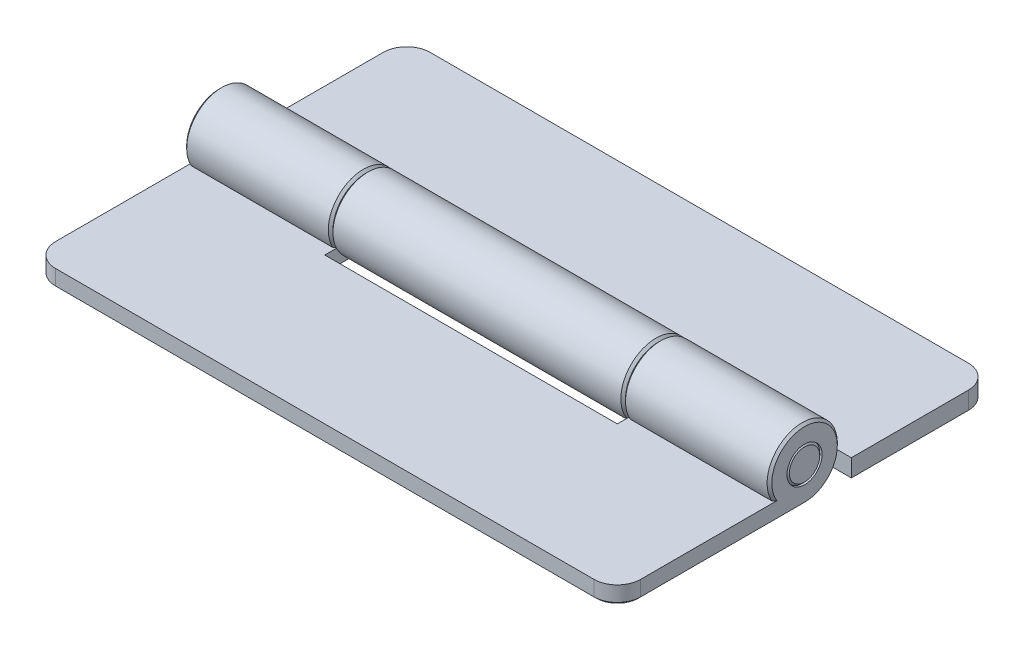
ISO-10303-21;
HEADER;
FILE_DESCRIPTION(('STEP AP214'),'2;1');
FILE_NAME('part.step','',(''),(''),'','','');
FILE_SCHEMA(('AUTOMOTIVE_DESIGN { 1 0 10303 214 1 1 1 1 }'));
ENDSEC;
DATA;
#1=APPLICATION_CONTEXT('core data for automotive mechanical design processes');
#2=APPLICATION_PROTOCOL_DEFINITION('international standard','automotive_design',2000,#1);
#3=PRODUCT_CONTEXT('',#1,'mechanical');
#4=PRODUCT('Part','Part','',(#3));
#5=PRODUCT_RELATED_PRODUCT_CATEGORY('part','',(#4));
#6=PRODUCT_DEFINITION_FORMATION('','',#4);
#7=PRODUCT_DEFINITION_CONTEXT('part definition',#1,'design');
#8=PRODUCT_DEFINITION('design','',#6,#7);
#9=PRODUCT_DEFINITION_SHAPE('','',#8);
#10=(LENGTH_UNIT() NAMED_UNIT(*) SI_UNIT(.MILLI.,.METRE.));
#11=(NAMED_UNIT(*) PLANE_ANGLE_UNIT() SI_UNIT($,.RADIAN.));
#12=(NAMED_UNIT(*) SI_UNIT($,.STERADIAN.) SOLID_ANGLE_UNIT());
#13=UNCERTAINTY_MEASURE_WITH_UNIT(LENGTH_MEASURE(1.E-05),#10,'distance_accuracy_value','');
#14=(GEOMETRIC_REPRESENTATION_CONTEXT(3) GLOBAL_UNCERTAINTY_ASSIGNED_CONTEXT((#13)) GLOBAL_UNIT_ASSIGNED_CONTEXT((#10,
#11,#12)) REPRESENTATION_CONTEXT('',''));
#15=CARTESIAN_POINT('',(0.,0.,0.));
#16=DIRECTION('',(0.,0.,1.));
#17=DIRECTION('',(1.,0.,0.));
#18=AXIS2_PLACEMENT_3D('',#15,#16,#17);
#19=CARTESIAN_POINT('',(25.,0.,0.));
#20=DIRECTION('',(-1.,0.,0.));
#21=DIRECTION('',(0.,0.,1.));
#22=AXIS2_PLACEMENT_3D('',#19,#20,#21);
#23=CYLINDRICAL_SURFACE('',#22,3.);
#24=DIRECTION('',(-1.,0.,0.));
#25=VECTOR('',#24,1.);
#26=CARTESIAN_POINT('',(25.,-1.5,2.59807621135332));
#27=LINE('',#26,#25);
#28=CARTESIAN_POINT('',(24.8,-1.5,2.59807621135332));
#29=VERTEX_POINT('',#28);
#30=CARTESIAN_POINT('',(12.7,-1.5,2.59807621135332));
#31=VERTEX_POINT('',#30);
#32=EDGE_CURVE('P0_E190',#29,#31,#27,.T.);
#33=ORIENTED_EDGE('',*,*,#32,.F.);
#34=CARTESIAN_POINT('',(24.8,0.,0.));
#35=DIRECTION('',(1.,0.,0.));
#36=DIRECTION('',(0.,0.,-1.));
#37=AXIS2_PLACEMENT_3D('',#34,#35,#36);
#38=CIRCLE('',#37,3.);
#39=CARTESIAN_POINT('',(24.8,-3.,0.));
#40=VERTEX_POINT('',#39);
#41=EDGE_CURVE('P0_E206',#29,#40,#38,.F.);
#42=ORIENTED_EDGE('',*,*,#41,.T.);
#43=DIRECTION('',(-1.,0.,0.));
#44=VECTOR('',#43,1.);
#45=CARTESIAN_POINT('',(25.,-3.,0.));
#46=LINE('',#45,#44);
#47=CARTESIAN_POINT('',(12.7,-3.,0.));
#48=VERTEX_POINT('',#47);
#49=EDGE_CURVE('P0_E140',#40,#48,#46,.T.);
#50=ORIENTED_EDGE('',*,*,#49,.T.);
#51=CARTESIAN_POINT('',(12.7,0.,0.));
#52=DIRECTION('',(1.,0.,0.));
#53=DIRECTION('',(0.,0.,-1.));
#54=AXIS2_PLACEMENT_3D('',#51,#52,#53);
#55=CIRCLE('',#54,3.);
#56=EDGE_CURVE('P0_E204',#48,#31,#55,.T.);
#57=ORIENTED_EDGE('',*,*,#56,.T.);
#58=EDGE_LOOP('',(#33,#42,#50,#57));
#59=FACE_BOUND('',#58,.T.);
#60=ADVANCED_FACE('P0_F15',(#59),#23,.T.);
#61=CARTESIAN_POINT('',(25.,0.,0.));
#62=DIRECTION('',(1.,0.,0.));
#63=DIRECTION('',(0.,0.,-1.));
#64=AXIS2_PLACEMENT_3D('',#61,#62,#63);
#65=PLANE('',#64);
#66=CARTESIAN_POINT('',(25.,0.,0.));
#67=DIRECTION('',(1.,0.,0.));
#68=DIRECTION('',(0.,0.,-1.));
#69=AXIS2_PLACEMENT_3D('',#66,#67,#68);
#70=CIRCLE('',#69,2.8);
#71=CARTESIAN_POINT('',(25.,-2.8,0.));
#72=VERTEX_POINT('',#71);
#73=CARTESIAN_POINT('',(25.,-1.5,2.36431808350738));
#74=VERTEX_POINT('',#73);
#75=EDGE_CURVE('P0_E201',#72,#74,#70,.T.);
#76=ORIENTED_EDGE('',*,*,#75,.T.);
#77=DIRECTION('',(0.,0.,-1.));
#78=VECTOR('',#77,1.);
#79=CARTESIAN_POINT('',(25.,-1.5,0.));
#80=LINE('',#79,#78);
#81=CARTESIAN_POINT('',(25.,-1.5,14.));
#82=VERTEX_POINT('',#81);
#83=EDGE_CURVE('P0_E166',#82,#74,#80,.T.);
#84=ORIENTED_EDGE('',*,*,#83,.F.);
#85=DIRECTION('',(0.,-1.,0.));
#86=VECTOR('',#85,1.);
#87=CARTESIAN_POINT('',(25.,-1.5,14.));
#88=LINE('',#87,#86);
#89=CARTESIAN_POINT('',(25.,-2.8,14.));
#90=VERTEX_POINT('',#89);
#91=EDGE_CURVE('P0_E178',#82,#90,#88,.T.);
#92=ORIENTED_EDGE('',*,*,#91,.T.);
#93=DIRECTION('',(0.,0.,-1.));
#94=VECTOR('',#93,1.);
#95=CARTESIAN_POINT('',(25.,-2.8,0.));
#96=LINE('',#95,#94);
#97=EDGE_CURVE('P0_E197',#90,#72,#96,.T.);
#98=ORIENTED_EDGE('',*,*,#97,.T.);
#99=EDGE_LOOP('',(#76,#84,#92,#98));
#100=FACE_BOUND('',#99,.T.);
#101=CARTESIAN_POINT('',(25.,0.,0.));
#102=DIRECTION('',(1.,0.,0.));
#103=DIRECTION('',(0.,0.,-1.));
#104=AXIS2_PLACEMENT_3D('',#101,#102,#103);
#105=CIRCLE('',#104,1.5);
#106=CARTESIAN_POINT('',(25.,0.,-1.5));
#107=VERTEX_POINT('',#106);
#108=EDGE_CURVE('P0_E194',#107,#107,#105,.T.);
#109=ORIENTED_EDGE('',*,*,#108,.F.);
#110=EDGE_LOOP('',(#109));
#111=FACE_BOUND('',#110,.T.);
#112=ADVANCED_FACE('P0_F360',(#100,#111),#65,.T.);
#113=CARTESIAN_POINT('',(12.5,0.,0.));
#114=DIRECTION('',(1.,0.,0.));
#115=DIRECTION('',(0.,0.,-1.));
#116=AXIS2_PLACEMENT_3D('',#113,#114,#115);
#117=PLANE('',#116);
#118=CARTESIAN_POINT('',(12.5,0.,0.));
#119=DIRECTION('',(1.,0.,0.));
#120=DIRECTION('',(0.,0.,-1.));
#121=AXIS2_PLACEMENT_3D('',#118,#119,#120);
#122=CIRCLE('',#121,2.8);
#123=CARTESIAN_POINT('',(12.5,-1.5,2.36431808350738));
#124=VERTEX_POINT('',#123);
#125=CARTESIAN_POINT('',(12.5,-2.8,0.));
#126=VERTEX_POINT('',#125);
#127=EDGE_CURVE('P0_E208',#124,#126,#122,.F.);
#128=ORIENTED_EDGE('',*,*,#127,.T.);
#129=DIRECTION('',(0.,0.,1.));
#130=VECTOR('',#129,1.);
#131=CARTESIAN_POINT('',(12.5,-2.8,3.5));
#132=LINE('',#131,#130);
#133=CARTESIAN_POINT('',(12.5,-2.8,3.5));
#134=VERTEX_POINT('',#133);
#135=EDGE_CURVE('P0_E210',#126,#134,#132,.T.);
#136=ORIENTED_EDGE('',*,*,#135,.T.);
#137=DIRECTION('',(0.,-1.,0.));
#138=VECTOR('',#137,1.);
#139=CARTESIAN_POINT('',(12.5,-1.5,3.5));
#140=LINE('',#139,#138);
#141=CARTESIAN_POINT('',(12.5,-1.5,3.5));
#142=VERTEX_POINT('',#141);
#143=EDGE_CURVE('P0_E187',#142,#134,#140,.T.);
#144=ORIENTED_EDGE('',*,*,#143,.F.);
#145=DIRECTION('',(0.,0.,1.));
#146=VECTOR('',#145,1.);
#147=CARTESIAN_POINT('',(12.5,-1.5,0.));
#148=LINE('',#147,#146);
#149=EDGE_CURVE('P0_E168',#124,#142,#148,.T.);
#150=ORIENTED_EDGE('',*,*,#149,.F.);
#151=EDGE_LOOP('',(#128,#136,#144,#150));
#152=FACE_BOUND('',#151,.T.);
#153=CARTESIAN_POINT('',(12.5,0.,0.));
#154=DIRECTION('',(1.,0.,0.));
#155=DIRECTION('',(0.,0.,-1.));
#156=AXIS2_PLACEMENT_3D('',#153,#154,#155);
#157=CIRCLE('',#156,1.5);
#158=CARTESIAN_POINT('',(12.5,0.,-1.5));
#159=VERTEX_POINT('',#158);
#160=EDGE_CURVE('P0_E193',#159,#159,#157,.T.);
#161=ORIENTED_EDGE('',*,*,#160,.T.);
#162=EDGE_LOOP('',(#161));
#163=FACE_BOUND('',#162,.T.);
#164=ADVANCED_FACE('P0_F365',(#152,#163),#117,.F.);
#165=CARTESIAN_POINT('',(25.,0.,0.));
#166=DIRECTION('',(-1.,0.,0.));
#167=DIRECTION('',(0.,0.,1.));
#168=AXIS2_PLACEMENT_3D('',#165,#166,#167);
#169=CYLINDRICAL_SURFACE('',#168,1.5);
#170=ORIENTED_EDGE('',*,*,#160,.F.);
#171=EDGE_LOOP('',(#170));
#172=FACE_BOUND('',#171,.T.);
#173=ORIENTED_EDGE('',*,*,#108,.T.);
#174=EDGE_LOOP('',(#173));
#175=FACE_BOUND('',#174,.T.);
#176=ADVANCED_FACE('P0_F561',(#172,#175),#169,.F.);
#177=CARTESIAN_POINT('',(23.,-1.5,14.));
#178=DIRECTION('',(0.,-1.,0.));
#179=DIRECTION('',(0.,0.,-1.));
#180=AXIS2_PLACEMENT_3D('',#177,#178,#179);
#181=PLANE('',#180);
#182=DIRECTION('',(0.,0.,1.));
#183=VECTOR('',#182,1.);
#184=CARTESIAN_POINT('',(-12.5,-1.5,0.));
#185=LINE('',#184,#183);
#186=CARTESIAN_POINT('',(-12.5,-1.5,2.36431808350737));
#187=VERTEX_POINT('',#186);
#188=CARTESIAN_POINT('',(-12.5,-1.5,3.5));
#189=VERTEX_POINT('',#188);
#190=EDGE_CURVE('P0_E154',#187,#189,#185,.T.);
#191=ORIENTED_EDGE('',*,*,#190,.F.);
#192=CARTESIAN_POINT('',(-12.5,-1.5,2.36431808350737));
#193=CARTESIAN_POINT('',(-12.5330904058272,-1.5,2.4034856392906));
#194=CARTESIAN_POINT('',(-12.566302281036,-1.5,2.44254926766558));
#195=CARTESIAN_POINT('',(-12.6329689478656,-1.5,2.52046864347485));
#196=CARTESIAN_POINT('',(-12.6664237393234,-1.5,2.55932439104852));
#197=CARTESIAN_POINT('',(-12.7,-1.5,2.59807621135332));
#198=B_SPLINE_CURVE_WITH_KNOTS('',3,(#192,#193,#194,#195,#196,#197),.UNSPECIFIED.,.F.,.F.,(4,2,
4),(0.,0.153821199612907,0.307642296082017),.UNSPECIFIED.);
#199=CARTESIAN_POINT('',(-12.7,-1.5,2.59807621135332));
#200=VERTEX_POINT('',#199);
#201=EDGE_CURVE('P0_E25',#187,#200,#198,.T.);
#202=ORIENTED_EDGE('',*,*,#201,.T.);
#203=DIRECTION('',(1.,0.,0.));
#204=VECTOR('',#203,1.);
#205=CARTESIAN_POINT('',(-25.,-1.5,2.59807621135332));
#206=LINE('',#205,#204);
#207=CARTESIAN_POINT('',(-24.8,-1.5,2.59807621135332));
#208=VERTEX_POINT('',#207);
#209=EDGE_CURVE('P0_E162',#200,#208,#206,.F.);
#210=ORIENTED_EDGE('',*,*,#209,.T.);
#211=CARTESIAN_POINT('',(-24.8,-1.5,2.59807621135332));
#212=CARTESIAN_POINT('',(-24.8335762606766,-1.5,2.55932439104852));
#213=CARTESIAN_POINT('',(-24.8670310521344,-1.5,2.52046864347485));
#214=CARTESIAN_POINT('',(-24.933697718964,-1.5,2.44254926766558));
#215=CARTESIAN_POINT('',(-24.9669095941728,-1.5,2.4034856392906));
#216=CARTESIAN_POINT('',(-25.,-1.5,2.36431808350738));
#217=B_SPLINE_CURVE_WITH_KNOTS('',3,(#211,#212,#213,#214,#215,#216),.UNSPECIFIED.,.F.,.F.,(4,2,
4),(0.,0.153821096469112,0.307642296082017),.UNSPECIFIED.);
#218=CARTESIAN_POINT('',(-25.,-1.5,2.36431808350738));
#219=VERTEX_POINT('',#218);
#220=EDGE_CURVE('P0_E10',#208,#219,#217,.T.);
#221=ORIENTED_EDGE('',*,*,#220,.T.);
#222=DIRECTION('',(0.,0.,-1.));
#223=VECTOR('',#222,1.);
#224=CARTESIAN_POINT('',(-25.,-1.5,0.));
#225=LINE('',#224,#223);
#226=CARTESIAN_POINT('',(-25.,-1.5,14.));
#227=VERTEX_POINT('',#226);
#228=EDGE_CURVE('P0_E38',#227,#219,#225,.T.);
#229=ORIENTED_EDGE('',*,*,#228,.F.);
#230=CARTESIAN_POINT('',(-23.,-1.5,14.));
#231=DIRECTION('',(0.,-1.,0.));
#232=DIRECTION('',(0.,0.,-1.));
#233=AXIS2_PLACEMENT_3D('',#230,#231,#232);
#234=CIRCLE('',#233,2.);
#235=CARTESIAN_POINT('',(-23.,-1.5,16.));
#236=VERTEX_POINT('',#235);
#237=EDGE_CURVE('P0_E146',#236,#227,#234,.T.);
#238=ORIENTED_EDGE('',*,*,#237,.F.);
#239=DIRECTION('',(1.,0.,0.));
#240=VECTOR('',#239,1.);
#241=CARTESIAN_POINT('',(23.,-1.5,16.));
#242=LINE('',#241,#240);
#243=CARTESIAN_POINT('',(23.,-1.5,16.));
#244=VERTEX_POINT('',#243);
#245=EDGE_CURVE('P0_E174',#236,#244,#242,.T.);
#246=ORIENTED_EDGE('',*,*,#245,.T.);
#247=CARTESIAN_POINT('',(23.,-1.5,14.));
#248=DIRECTION('',(0.,1.,0.));
#249=DIRECTION('',(0.,0.,-1.));
#250=AXIS2_PLACEMENT_3D('',#247,#248,#249);
#251=CIRCLE('',#250,2.);
#252=EDGE_CURVE('P0_E176',#244,#82,#251,.T.);
#253=ORIENTED_EDGE('',*,*,#252,.T.);
#254=ORIENTED_EDGE('',*,*,#83,.T.);
#255=CARTESIAN_POINT('',(25.,-1.5,2.36431808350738));
#256=CARTESIAN_POINT('',(24.9669095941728,-1.5,2.40348563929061));
#257=CARTESIAN_POINT('',(24.933697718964,-1.5,2.44254926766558));
#258=CARTESIAN_POINT('',(24.8670310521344,-1.5,2.52046864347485));
#259=CARTESIAN_POINT('',(24.8335762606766,-1.5,2.55932439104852));
#260=CARTESIAN_POINT('',(24.8,-1.5,2.59807621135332));
#261=B_SPLINE_CURVE_WITH_KNOTS('',3,(#255,#256,#257,#258,#259,#260),.UNSPECIFIED.,.F.,.F.,(4,2,
4),(0.,0.153821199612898,0.307642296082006),.UNSPECIFIED.);
#262=EDGE_CURVE('P0_E245',#74,#29,#261,.T.);
#263=ORIENTED_EDGE('',*,*,#262,.T.);
#264=ORIENTED_EDGE('',*,*,#32,.T.);
#265=CARTESIAN_POINT('',(12.7,-1.5,2.59807621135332));
#266=CARTESIAN_POINT('',(12.6664237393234,-1.5,2.55932439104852));
#267=CARTESIAN_POINT('',(12.6329689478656,-1.5,2.52046864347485));
#268=CARTESIAN_POINT('',(12.566302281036,-1.5,2.44254926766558));
#269=CARTESIAN_POINT('',(12.5330904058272,-1.5,2.40348563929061));
#270=CARTESIAN_POINT('',(12.5,-1.5,2.36431808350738));
#271=B_SPLINE_CURVE_WITH_KNOTS('',3,(#265,#266,#267,#268,#269,#270),.UNSPECIFIED.,.F.,.F.,(4,2,
4),(0.,0.15382109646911,0.307642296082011),.UNSPECIFIED.);
#272=EDGE_CURVE('P0_E346',#31,#124,#271,.T.);
#273=ORIENTED_EDGE('',*,*,#272,.T.);
#274=ORIENTED_EDGE('',*,*,#149,.T.);
#275=DIRECTION('',(-1.,0.,0.));
#276=VECTOR('',#275,1.);
#277=CARTESIAN_POINT('',(12.5,-1.5,3.5));
#278=LINE('',#277,#276);
#279=EDGE_CURVE('P0_E171',#142,#189,#278,.T.);
#280=ORIENTED_EDGE('',*,*,#279,.T.);
#281=EDGE_LOOP('',(#191,#202,#210,#221,#229,#238,#246,#253,#254,#263,#264,#273,#274,#280));
#282=FACE_BOUND('',#281,.T.);
#283=ADVANCED_FACE('P0_F145',(#282),#181,.F.);
#284=CARTESIAN_POINT('',(12.5,-1.5,3.5));
#285=DIRECTION('',(0.,0.,1.));
#286=DIRECTION('',(1.,0.,0.));
#287=AXIS2_PLACEMENT_3D('',#284,#285,#286);
#288=PLANE('',#287);
#289=DIRECTION('',(-1.,0.,0.));
#290=VECTOR('',#289,1.);
#291=CARTESIAN_POINT('',(12.5,-3.,3.5));
#292=LINE('',#291,#290);
#293=CARTESIAN_POINT('',(12.7,-3.,3.5));
#294=VERTEX_POINT('',#293);
#295=CARTESIAN_POINT('',(-12.7,-3.,3.50000000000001));
#296=VERTEX_POINT('',#295);
#297=EDGE_CURVE('P0_E169',#294,#296,#292,.T.);
#298=ORIENTED_EDGE('',*,*,#297,.T.);
#299=DIRECTION('',(-0.707106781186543,-0.707106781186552,0.));
#300=VECTOR('',#299,1.);
#301=CARTESIAN_POINT('',(0.649999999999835,10.35,3.5));
#302=LINE('',#301,#300);
#303=CARTESIAN_POINT('',(-12.5,-2.8,3.5));
#304=VERTEX_POINT('',#303);
#305=EDGE_CURVE('P0_E344',#296,#304,#302,.F.);
#306=ORIENTED_EDGE('',*,*,#305,.T.);
#307=DIRECTION('',(0.,-1.,0.));
#308=VECTOR('',#307,1.);
#309=CARTESIAN_POINT('',(-12.5,-1.5,3.5));
#310=LINE('',#309,#308);
#311=EDGE_CURVE('P0_E156',#189,#304,#310,.T.);
#312=ORIENTED_EDGE('',*,*,#311,.F.);
#313=ORIENTED_EDGE('',*,*,#279,.F.);
#314=ORIENTED_EDGE('',*,*,#143,.T.);
#315=DIRECTION('',(0.707106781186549,-0.707106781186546,0.));
#316=VECTOR('',#315,1.);
#317=CARTESIAN_POINT('',(11.85,-2.15,3.5));
#318=LINE('',#317,#316);
#319=EDGE_CURVE('P0_E252',#134,#294,#318,.T.);
#320=ORIENTED_EDGE('',*,*,#319,.T.);
#321=EDGE_LOOP('',(#298,#306,#312,#313,#314,#320));
#322=FACE_BOUND('',#321,.T.);
#323=ADVANCED_FACE('P0_F343',(#322),#288,.F.);
#324=CARTESIAN_POINT('',(23.,-1.5,16.));
#325=DIRECTION('',(0.,0.,-1.));
#326=DIRECTION('',(-1.,0.,0.));
#327=AXIS2_PLACEMENT_3D('',#324,#325,#326);
#328=PLANE('',#327);
#329=DIRECTION('',(0.,-1.,0.));
#330=VECTOR('',#329,1.);
#331=CARTESIAN_POINT('',(-23.,-1.5,16.));
#332=LINE('',#331,#330);
#333=CARTESIAN_POINT('',(-23.,-2.8,16.));
#334=VERTEX_POINT('',#333);
#335=EDGE_CURVE('P0_E141',#236,#334,#332,.T.);
#336=ORIENTED_EDGE('',*,*,#335,.T.);
#337=DIRECTION('',(1.,0.,0.));
#338=VECTOR('',#337,1.);
#339=CARTESIAN_POINT('',(23.,-2.8,16.));
#340=LINE('',#339,#338);
#341=CARTESIAN_POINT('',(23.,-2.8,16.));
#342=VERTEX_POINT('',#341);
#343=EDGE_CURVE('P0_E239',#334,#342,#340,.T.);
#344=ORIENTED_EDGE('',*,*,#343,.T.);
#345=DIRECTION('',(0.,-1.,0.));
#346=VECTOR('',#345,1.);
#347=CARTESIAN_POINT('',(23.,-1.5,16.));
#348=LINE('',#347,#346);
#349=EDGE_CURVE('P0_E184',#244,#342,#348,.T.);
#350=ORIENTED_EDGE('',*,*,#349,.F.);
#351=ORIENTED_EDGE('',*,*,#245,.F.);
#352=EDGE_LOOP('',(#336,#344,#350,#351));
#353=FACE_BOUND('',#352,.T.);
#354=ADVANCED_FACE('P0_F537',(#353),#328,.F.);
#355=CARTESIAN_POINT('',(23.,-1.5,14.));
#356=DIRECTION('',(0.,-1.,0.));
#357=DIRECTION('',(0.,0.,-1.));
#358=AXIS2_PLACEMENT_3D('',#355,#356,#357);
#359=CYLINDRICAL_SURFACE('',#358,2.);
#360=ORIENTED_EDGE('',*,*,#349,.T.);
#361=CARTESIAN_POINT('',(23.,-2.8,14.));
#362=DIRECTION('',(0.,-1.,0.));
#363=DIRECTION('',(0.,0.,-1.));
#364=AXIS2_PLACEMENT_3D('',#361,#362,#363);
#365=CIRCLE('',#364,2.);
#366=EDGE_CURVE('P0_E237',#342,#90,#365,.F.);
#367=ORIENTED_EDGE('',*,*,#366,.T.);
#368=ORIENTED_EDGE('',*,*,#91,.F.);
#369=ORIENTED_EDGE('',*,*,#252,.F.);
#370=EDGE_LOOP('',(#360,#367,#368,#369));
#371=FACE_BOUND('',#370,.T.);
#372=ADVANCED_FACE('P0_F416',(#371),#359,.T.);
#373=CARTESIAN_POINT('',(23.,-3.,14.));
#374=DIRECTION('',(0.,-1.,0.));
#375=DIRECTION('',(0.,0.,-1.));
#376=AXIS2_PLACEMENT_3D('',#373,#374,#375);
#377=PLANE('',#376);
#378=ORIENTED_EDGE('',*,*,#297,.F.);
#379=DIRECTION('',(0.,0.,-1.));
#380=VECTOR('',#379,1.);
#381=CARTESIAN_POINT('',(12.7,-3.,0.));
#382=LINE('',#381,#380);
#383=EDGE_CURVE('P0_E226',#294,#48,#382,.T.);
#384=ORIENTED_EDGE('',*,*,#383,.T.);
#385=ORIENTED_EDGE('',*,*,#49,.F.);
#386=DIRECTION('',(0.,0.,1.));
#387=VECTOR('',#386,1.);
#388=CARTESIAN_POINT('',(24.8,-3.,14.));
#389=LINE('',#388,#387);
#390=CARTESIAN_POINT('',(24.8,-3.,14.));
#391=VERTEX_POINT('',#390);
#392=EDGE_CURVE('P0_E221',#40,#391,#389,.T.);
#393=ORIENTED_EDGE('',*,*,#392,.T.);
#394=CARTESIAN_POINT('',(23.,-3.,14.));
#395=DIRECTION('',(0.,-1.,0.));
#396=DIRECTION('',(0.,0.,-1.));
#397=AXIS2_PLACEMENT_3D('',#394,#395,#396);
#398=CIRCLE('',#397,1.8);
#399=CARTESIAN_POINT('',(23.,-3.,15.8));
#400=VERTEX_POINT('',#399);
#401=EDGE_CURVE('P0_E219',#391,#400,#398,.T.);
#402=ORIENTED_EDGE('',*,*,#401,.T.);
#403=DIRECTION('',(-1.,0.,0.));
#404=VECTOR('',#403,1.);
#405=CARTESIAN_POINT('',(-23.,-3.,15.8));
#406=LINE('',#405,#404);
#407=CARTESIAN_POINT('',(-23.,-3.,15.8));
#408=VERTEX_POINT('',#407);
#409=EDGE_CURVE('P0_E217',#400,#408,#406,.T.);
#410=ORIENTED_EDGE('',*,*,#409,.T.);
#411=CARTESIAN_POINT('',(-23.,-3.,14.));
#412=DIRECTION('',(0.,-1.,0.));
#413=DIRECTION('',(0.,0.,-1.));
#414=AXIS2_PLACEMENT_3D('',#411,#412,#413);
#415=CIRCLE('',#414,1.79999999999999);
#416=CARTESIAN_POINT('',(-24.8,-3.,14.));
#417=VERTEX_POINT('',#416);
#418=EDGE_CURVE('P0_E215',#408,#417,#415,.T.);
#419=ORIENTED_EDGE('',*,*,#418,.T.);
#420=DIRECTION('',(0.,0.,-1.));
#421=VECTOR('',#420,1.);
#422=CARTESIAN_POINT('',(-24.8,-3.,14.));
#423=LINE('',#422,#421);
#424=CARTESIAN_POINT('',(-24.8,-3.,0.));
#425=VERTEX_POINT('',#424);
#426=EDGE_CURVE('P0_E213',#417,#425,#423,.T.);
#427=ORIENTED_EDGE('',*,*,#426,.T.);
#428=DIRECTION('',(1.,0.,0.));
#429=VECTOR('',#428,1.);
#430=CARTESIAN_POINT('',(-25.,-3.,0.));
#431=LINE('',#430,#429);
#432=CARTESIAN_POINT('',(-12.7,-3.,0.));
#433=VERTEX_POINT('',#432);
#434=EDGE_CURVE('P0_E149',#425,#433,#431,.T.);
#435=ORIENTED_EDGE('',*,*,#434,.T.);
#436=DIRECTION('',(0.,0.,1.));
#437=VECTOR('',#436,1.);
#438=CARTESIAN_POINT('',(-12.7,-3.,14.));
#439=LINE('',#438,#437);
#440=EDGE_CURVE('P0_E223',#433,#296,#439,.T.);
#441=ORIENTED_EDGE('',*,*,#440,.T.);
#442=EDGE_LOOP('',(#378,#384,#385,#393,#402,#410,#419,#427,#435,#441));
#443=FACE_BOUND('',#442,.T.);
#444=ADVANCED_FACE('P0_F381',(#443),#377,.T.);
#445=CARTESIAN_POINT('',(-25.,-1.5,0.));
#446=DIRECTION('',(-1.,0.,0.));
#447=DIRECTION('',(0.,0.,1.));
#448=AXIS2_PLACEMENT_3D('',#445,#446,#447);
#449=PLANE('',#448);
#450=CARTESIAN_POINT('',(-25.,0.,0.));
#451=DIRECTION('',(1.,0.,0.));
#452=DIRECTION('',(0.,0.,-1.));
#453=AXIS2_PLACEMENT_3D('',#450,#451,#452);
#454=CIRCLE('',#453,1.5);
#455=CARTESIAN_POINT('',(-25.,0.,-1.5));
#456=VERTEX_POINT('',#455);
#457=EDGE_CURVE('P0_E395',#456,#456,#454,.T.);
#458=ORIENTED_EDGE('',*,*,#457,.T.);
#459=EDGE_LOOP('',(#458));
#460=FACE_BOUND('',#459,.T.);
#461=CARTESIAN_POINT('',(-25.,0.,0.));
#462=DIRECTION('',(-1.,0.,0.));
#463=DIRECTION('',(0.,0.,1.));
#464=AXIS2_PLACEMENT_3D('',#461,#462,#463);
#465=CIRCLE('',#464,2.8);
#466=CARTESIAN_POINT('',(-25.,-2.8,0.));
#467=VERTEX_POINT('',#466);
#468=EDGE_CURVE('P0_E33',#219,#467,#465,.T.);
#469=ORIENTED_EDGE('',*,*,#468,.T.);
#470=DIRECTION('',(0.,0.,1.));
#471=VECTOR('',#470,1.);
#472=CARTESIAN_POINT('',(-25.,-2.8,0.));
#473=LINE('',#472,#471);
#474=CARTESIAN_POINT('',(-25.,-2.8,14.));
#475=VERTEX_POINT('',#474);
#476=EDGE_CURVE('P0_E136',#467,#475,#473,.T.);
#477=ORIENTED_EDGE('',*,*,#476,.T.);
#478=DIRECTION('',(0.,-1.,0.));
#479=VECTOR('',#478,1.);
#480=CARTESIAN_POINT('',(-25.,-1.5,14.));
#481=LINE('',#480,#479);
#482=EDGE_CURVE('P0_E133',#227,#475,#481,.T.);
#483=ORIENTED_EDGE('',*,*,#482,.F.);
#484=ORIENTED_EDGE('',*,*,#228,.T.);
#485=EDGE_LOOP('',(#469,#477,#483,#484));
#486=FACE_BOUND('',#485,.T.);
#487=ADVANCED_FACE('P0_F134',(#460,#486),#449,.T.);
#488=CARTESIAN_POINT('',(-23.,-1.5,14.));
#489=DIRECTION('',(0.,-1.,0.));
#490=DIRECTION('',(0.,0.,-1.));
#491=AXIS2_PLACEMENT_3D('',#488,#489,#490);
#492=CYLINDRICAL_SURFACE('',#491,2.);
#493=ORIENTED_EDGE('',*,*,#482,.T.);
#494=CARTESIAN_POINT('',(-23.,-2.8,14.));
#495=DIRECTION('',(0.,-1.,0.));
#496=DIRECTION('',(0.,0.,-1.));
#497=AXIS2_PLACEMENT_3D('',#494,#495,#496);
#498=CIRCLE('',#497,2.);
#499=EDGE_CURVE('P0_E241',#475,#334,#498,.F.);
#500=ORIENTED_EDGE('',*,*,#499,.T.);
#501=ORIENTED_EDGE('',*,*,#335,.F.);
#502=ORIENTED_EDGE('',*,*,#237,.T.);
#503=EDGE_LOOP('',(#493,#500,#501,#502));
#504=FACE_BOUND('',#503,.T.);
#505=ADVANCED_FACE('P0_F152',(#504),#492,.T.);
#506=CARTESIAN_POINT('',(-12.5,-1.5,0.));
#507=DIRECTION('',(1.,0.,0.));
#508=DIRECTION('',(0.,0.,-1.));
#509=AXIS2_PLACEMENT_3D('',#506,#507,#508);
#510=PLANE('',#509);
#511=ORIENTED_EDGE('',*,*,#311,.T.);
#512=DIRECTION('',(0.,0.,-1.));
#513=VECTOR('',#512,1.);
#514=CARTESIAN_POINT('',(-12.5,-2.8,0.));
#515=LINE('',#514,#513);
#516=CARTESIAN_POINT('',(-12.5,-2.8,0.));
#517=VERTEX_POINT('',#516);
#518=EDGE_CURVE('P0_E231',#304,#517,#515,.T.);
#519=ORIENTED_EDGE('',*,*,#518,.T.);
#520=CARTESIAN_POINT('',(-12.5,0.,0.));
#521=DIRECTION('',(1.,0.,0.));
#522=DIRECTION('',(0.,0.,-1.));
#523=AXIS2_PLACEMENT_3D('',#520,#521,#522);
#524=CIRCLE('',#523,2.8);
#525=EDGE_CURVE('P0_E228',#517,#187,#524,.T.);
#526=ORIENTED_EDGE('',*,*,#525,.T.);
#527=ORIENTED_EDGE('',*,*,#190,.T.);
#528=EDGE_LOOP('',(#511,#519,#526,#527));
#529=FACE_BOUND('',#528,.T.);
#530=CARTESIAN_POINT('',(-12.5,0.,0.));
#531=DIRECTION('',(1.,0.,0.));
#532=DIRECTION('',(0.,0.,-1.));
#533=AXIS2_PLACEMENT_3D('',#530,#531,#532);
#534=CIRCLE('',#533,1.5);
#535=CARTESIAN_POINT('',(-12.5,0.,-1.5));
#536=VERTEX_POINT('',#535);
#537=EDGE_CURVE('P0_E320',#536,#536,#534,.T.);
#538=ORIENTED_EDGE('',*,*,#537,.F.);
#539=EDGE_LOOP('',(#538));
#540=FACE_BOUND('',#539,.T.);
#541=ADVANCED_FACE('P0_F338',(#529,#540),#510,.T.);
#542=CARTESIAN_POINT('',(-25.,0.,0.));
#543=DIRECTION('',(1.,0.,0.));
#544=DIRECTION('',(0.,0.,-1.));
#545=AXIS2_PLACEMENT_3D('',#542,#543,#544);
#546=CYLINDRICAL_SURFACE('',#545,3.);
#547=ORIENTED_EDGE('',*,*,#209,.F.);
#548=CARTESIAN_POINT('',(-12.7,0.,0.));
#549=DIRECTION('',(1.,0.,0.));
#550=DIRECTION('',(0.,0.,-1.));
#551=AXIS2_PLACEMENT_3D('',#548,#549,#550);
#552=CIRCLE('',#551,3.);
#553=EDGE_CURVE('P0_E235',#200,#433,#552,.F.);
#554=ORIENTED_EDGE('',*,*,#553,.T.);
#555=ORIENTED_EDGE('',*,*,#434,.F.);
#556=CARTESIAN_POINT('',(-24.8,0.,0.));
#557=DIRECTION('',(-1.,0.,0.));
#558=DIRECTION('',(0.,0.,1.));
#559=AXIS2_PLACEMENT_3D('',#556,#557,#558);
#560=CIRCLE('',#559,3.);
#561=EDGE_CURVE('P0_E233',#425,#208,#560,.F.);
#562=ORIENTED_EDGE('',*,*,#561,.T.);
#563=EDGE_LOOP('',(#547,#554,#555,#562));
#564=FACE_BOUND('',#563,.T.);
#565=ADVANCED_FACE('P0_F394',(#564),#546,.T.);
#566=CARTESIAN_POINT('',(-25.,0.,0.));
#567=DIRECTION('',(1.,0.,0.));
#568=DIRECTION('',(0.,0.,-1.));
#569=AXIS2_PLACEMENT_3D('',#566,#567,#568);
#570=CYLINDRICAL_SURFACE('',#569,1.5);
#571=ORIENTED_EDGE('',*,*,#457,.F.);
#572=EDGE_LOOP('',(#571));
#573=FACE_BOUND('',#572,.T.);
#574=ORIENTED_EDGE('',*,*,#537,.T.);
#575=EDGE_LOOP('',(#574));
#576=FACE_BOUND('',#575,.T.);
#577=ADVANCED_FACE('P0_F289',(#573,#576),#570,.F.);
#578=CARTESIAN_POINT('',(-24.8,0.,0.));
#579=DIRECTION('',(1.,0.,0.));
#580=DIRECTION('',(0.,0.,-1.));
#581=AXIS2_PLACEMENT_3D('',#578,#579,#580);
#582=CONICAL_SURFACE('',#581,3.,0.785398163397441);
#583=ORIENTED_EDGE('',*,*,#220,.F.);
#584=ORIENTED_EDGE('',*,*,#561,.F.);
#585=DIRECTION('',(0.707106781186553,-0.707106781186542,0.));
#586=VECTOR('',#585,1.);
#587=CARTESIAN_POINT('',(-25.,-2.8,0.));
#588=LINE('',#587,#586);
#589=EDGE_CURVE('P0_E318',#467,#425,#588,.T.);
#590=ORIENTED_EDGE('',*,*,#589,.F.);
#591=ORIENTED_EDGE('',*,*,#468,.F.);
#592=EDGE_LOOP('',(#583,#584,#590,#591));
#593=FACE_BOUND('',#592,.T.);
#594=ADVANCED_FACE('P0_F284',(#593),#582,.T.);
#595=CARTESIAN_POINT('',(-24.8,-3.,14.));
#596=DIRECTION('',(0.707106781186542,0.707106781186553,0.));
#597=DIRECTION('',(0.,0.,-1.));
#598=AXIS2_PLACEMENT_3D('',#595,#596,#597);
#599=PLANE('',#598);
#600=ORIENTED_EDGE('',*,*,#589,.T.);
#601=ORIENTED_EDGE('',*,*,#426,.F.);
#602=DIRECTION('',(0.707106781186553,-0.707106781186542,0.));
#603=VECTOR('',#602,1.);
#604=CARTESIAN_POINT('',(-25.,-2.8,14.));
#605=LINE('',#604,#603);
#606=EDGE_CURVE('P0_E315',#475,#417,#605,.T.);
#607=ORIENTED_EDGE('',*,*,#606,.F.);
#608=ORIENTED_EDGE('',*,*,#476,.F.);
#609=EDGE_LOOP('',(#600,#601,#607,#608));
#610=FACE_BOUND('',#609,.T.);
#611=ADVANCED_FACE('P0_F280',(#610),#599,.F.);
#612=CARTESIAN_POINT('',(-23.,-3.,14.));
#613=DIRECTION('',(0.,1.,0.));
#614=DIRECTION('',(0.,0.,1.));
#615=AXIS2_PLACEMENT_3D('',#612,#613,#614);
#616=CONICAL_SURFACE('',#615,1.79999999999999,0.785398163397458);
#617=ORIENTED_EDGE('',*,*,#606,.T.);
#618=ORIENTED_EDGE('',*,*,#418,.F.);
#619=DIRECTION('',(0.,-0.707106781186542,-0.707106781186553));
#620=VECTOR('',#619,1.);
#621=CARTESIAN_POINT('',(-23.,-2.8,16.));
#622=LINE('',#621,#620);
#623=EDGE_CURVE('P0_E312',#334,#408,#622,.T.);
#624=ORIENTED_EDGE('',*,*,#623,.F.);
#625=ORIENTED_EDGE('',*,*,#499,.F.);
#626=EDGE_LOOP('',(#617,#618,#624,#625));
#627=FACE_BOUND('',#626,.T.);
#628=ADVANCED_FACE('P0_F276',(#627),#616,.T.);
#629=CARTESIAN_POINT('',(23.,-2.8,16.));
#630=DIRECTION('',(0.,-0.707106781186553,0.707106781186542));
#631=DIRECTION('',(-1.,0.,0.));
#632=AXIS2_PLACEMENT_3D('',#629,#630,#631);
#633=PLANE('',#632);
#634=ORIENTED_EDGE('',*,*,#623,.T.);
#635=ORIENTED_EDGE('',*,*,#409,.F.);
#636=DIRECTION('',(0.,-0.707106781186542,-0.707106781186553));
#637=VECTOR('',#636,1.);
#638=CARTESIAN_POINT('',(23.,-2.8,16.));
#639=LINE('',#638,#637);
#640=EDGE_CURVE('P0_E309',#342,#400,#639,.T.);
#641=ORIENTED_EDGE('',*,*,#640,.F.);
#642=ORIENTED_EDGE('',*,*,#343,.F.);
#643=EDGE_LOOP('',(#634,#635,#641,#642));
#644=FACE_BOUND('',#643,.T.);
#645=ADVANCED_FACE('P0_F272',(#644),#633,.T.);
#646=CARTESIAN_POINT('',(23.,-2.8,14.));
#647=DIRECTION('',(0.,1.,0.));
#648=DIRECTION('',(0.,0.,1.));
#649=AXIS2_PLACEMENT_3D('',#646,#647,#648);
#650=CONICAL_SURFACE('',#649,2.,0.785398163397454);
#651=ORIENTED_EDGE('',*,*,#640,.T.);
#652=ORIENTED_EDGE('',*,*,#401,.F.);
#653=DIRECTION('',(-0.707106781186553,-0.707106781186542,0.));
#654=VECTOR('',#653,1.);
#655=CARTESIAN_POINT('',(25.,-2.8,14.));
#656=LINE('',#655,#654);
#657=EDGE_CURVE('P0_E305',#90,#391,#656,.T.);
#658=ORIENTED_EDGE('',*,*,#657,.F.);
#659=ORIENTED_EDGE('',*,*,#366,.F.);
#660=EDGE_LOOP('',(#651,#652,#658,#659));
#661=FACE_BOUND('',#660,.T.);
#662=ADVANCED_FACE('P0_F268',(#661),#650,.T.);
#663=CARTESIAN_POINT('',(25.,-2.8,0.));
#664=DIRECTION('',(-0.707106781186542,0.707106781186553,0.));
#665=DIRECTION('',(0.,0.,-1.));
#666=AXIS2_PLACEMENT_3D('',#663,#664,#665);
#667=PLANE('',#666);
#668=ORIENTED_EDGE('',*,*,#657,.T.);
#669=ORIENTED_EDGE('',*,*,#392,.F.);
#670=DIRECTION('',(-0.707106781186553,-0.707106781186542,0.));
#671=VECTOR('',#670,1.);
#672=CARTESIAN_POINT('',(25.,-2.8,0.));
#673=LINE('',#672,#671);
#674=EDGE_CURVE('P0_E302',#72,#40,#673,.T.);
#675=ORIENTED_EDGE('',*,*,#674,.F.);
#676=ORIENTED_EDGE('',*,*,#97,.F.);
#677=EDGE_LOOP('',(#668,#669,#675,#676));
#678=FACE_BOUND('',#677,.T.);
#679=ADVANCED_FACE('P0_F263',(#678),#667,.F.);
#680=CARTESIAN_POINT('',(25.,0.,0.));
#681=DIRECTION('',(-1.,0.,0.));
#682=DIRECTION('',(0.,0.,1.));
#683=AXIS2_PLACEMENT_3D('',#680,#681,#682);
#684=CONICAL_SURFACE('',#683,2.8,0.785398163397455);
#685=ORIENTED_EDGE('',*,*,#674,.T.);
#686=ORIENTED_EDGE('',*,*,#41,.F.);
#687=ORIENTED_EDGE('',*,*,#262,.F.);
#688=ORIENTED_EDGE('',*,*,#75,.F.);
#689=EDGE_LOOP('',(#685,#686,#687,#688));
#690=FACE_BOUND('',#689,.T.);
#691=ADVANCED_FACE('P0_F257',(#690),#684,.T.);
#692=CARTESIAN_POINT('',(12.7,0.,0.));
#693=DIRECTION('',(1.,0.,0.));
#694=DIRECTION('',(0.,0.,-1.));
#695=AXIS2_PLACEMENT_3D('',#692,#693,#694);
#696=CONICAL_SURFACE('',#695,3.,0.785398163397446);
#697=ORIENTED_EDGE('',*,*,#272,.F.);
#698=ORIENTED_EDGE('',*,*,#56,.F.);
#699=DIRECTION('',(0.707106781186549,-0.707106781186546,0.));
#700=VECTOR('',#699,1.);
#701=CARTESIAN_POINT('',(12.5,-2.8,0.));
#702=LINE('',#701,#700);
#703=EDGE_CURVE('P0_E306',#126,#48,#702,.T.);
#704=ORIENTED_EDGE('',*,*,#703,.F.);
#705=ORIENTED_EDGE('',*,*,#127,.F.);
#706=EDGE_LOOP('',(#697,#698,#704,#705));
#707=FACE_BOUND('',#706,.T.);
#708=ADVANCED_FACE('P0_F262',(#707),#696,.T.);
#709=CARTESIAN_POINT('',(12.5,-2.8,0.));
#710=DIRECTION('',(-0.707106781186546,-0.707106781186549,0.));
#711=DIRECTION('',(0.,0.,-1.));
#712=AXIS2_PLACEMENT_3D('',#709,#710,#711);
#713=PLANE('',#712);
#714=ORIENTED_EDGE('',*,*,#703,.T.);
#715=ORIENTED_EDGE('',*,*,#383,.F.);
#716=ORIENTED_EDGE('',*,*,#319,.F.);
#717=ORIENTED_EDGE('',*,*,#135,.F.);
#718=EDGE_LOOP('',(#714,#715,#716,#717));
#719=FACE_BOUND('',#718,.T.);
#720=ADVANCED_FACE('P0_F291',(#719),#713,.T.);
#721=CARTESIAN_POINT('',(-12.5,0.,0.));
#722=DIRECTION('',(-1.,0.,0.));
#723=DIRECTION('',(0.,0.,1.));
#724=AXIS2_PLACEMENT_3D('',#721,#722,#723);
#725=CONICAL_SURFACE('',#724,2.8,0.785398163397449);
#726=ORIENTED_EDGE('',*,*,#201,.F.);
#727=ORIENTED_EDGE('',*,*,#525,.F.);
#728=DIRECTION('',(0.707106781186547,0.707106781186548,0.));
#729=VECTOR('',#728,1.);
#730=CARTESIAN_POINT('',(-12.7,-3.,0.));
#731=LINE('',#730,#729);
#732=EDGE_CURVE('P0_E20',#433,#517,#731,.T.);
#733=ORIENTED_EDGE('',*,*,#732,.F.);
#734=ORIENTED_EDGE('',*,*,#553,.F.);
#735=EDGE_LOOP('',(#726,#727,#733,#734));
#736=FACE_BOUND('',#735,.T.);
#737=ADVANCED_FACE('P0_F17',(#736),#725,.T.);
#738=CARTESIAN_POINT('',(-12.7,-3.,14.));
#739=DIRECTION('',(-0.707106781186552,0.707106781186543,0.));
#740=DIRECTION('',(0.,0.,1.));
#741=AXIS2_PLACEMENT_3D('',#738,#739,#740);
#742=PLANE('',#741);
#743=ORIENTED_EDGE('',*,*,#732,.T.);
#744=ORIENTED_EDGE('',*,*,#518,.F.);
#745=ORIENTED_EDGE('',*,*,#305,.F.);
#746=ORIENTED_EDGE('',*,*,#440,.F.);
#747=EDGE_LOOP('',(#743,#744,#745,#746));
#748=FACE_BOUND('',#747,.T.);
#749=ADVANCED_FACE('P0_F331',(#748),#742,.F.);
#750=CLOSED_SHELL('',(#60,#112,#164,#176,#283,#323,#354,#372,#444,#487,#505,#541,#565,#577,#594,
#611,#628,#645,#662,#679,#691,#708,#720,#737,#749));
#751=MANIFOLD_SOLID_BREP('P0_B1',#750);
#752=CARTESIAN_POINT('',(12.5,0.,0.));
#753=DIRECTION('',(-1.,0.,0.));
#754=DIRECTION('',(0.,0.,1.));
#755=AXIS2_PLACEMENT_3D('',#752,#753,#754);
#756=CYLINDRICAL_SURFACE('',#755,3.);
#757=DIRECTION('',(1.,0.,0.));
#758=VECTOR('',#757,1.);
#759=CARTESIAN_POINT('',(12.5,-3.,0.));
#760=LINE('',#759,#758);
#761=CARTESIAN_POINT('',(-12.3,-3.,0.));
#762=VERTEX_POINT('',#761);
#763=CARTESIAN_POINT('',(12.3,-3.,0.));
#764=VERTEX_POINT('',#763);
#765=EDGE_CURVE('P1_E123',#762,#764,#760,.T.);
#766=ORIENTED_EDGE('',*,*,#765,.T.);
#767=CARTESIAN_POINT('',(12.3,0.,0.));
#768=DIRECTION('',(1.,0.,0.));
#769=DIRECTION('',(0.,0.,-1.));
#770=AXIS2_PLACEMENT_3D('',#767,#768,#769);
#771=CIRCLE('',#770,3.);
#772=CARTESIAN_POINT('',(12.3,-1.5,-2.59807621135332));
#773=VERTEX_POINT('',#772);
#774=EDGE_CURVE('P1_E162',#764,#773,#771,.F.);
#775=ORIENTED_EDGE('',*,*,#774,.T.);
#776=DIRECTION('',(-1.,0.,0.));
#777=VECTOR('',#776,1.);
#778=CARTESIAN_POINT('',(12.5,-1.5,-2.59807621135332));
#779=LINE('',#778,#777);
#780=CARTESIAN_POINT('',(-12.3,-1.5,-2.59807621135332));
#781=VERTEX_POINT('',#780);
#782=EDGE_CURVE('P1_E139',#781,#773,#779,.F.);
#783=ORIENTED_EDGE('',*,*,#782,.F.);
#784=CARTESIAN_POINT('',(-12.3,0.,0.));
#785=DIRECTION('',(1.,0.,0.));
#786=DIRECTION('',(0.,0.,-1.));
#787=AXIS2_PLACEMENT_3D('',#784,#785,#786);
#788=CIRCLE('',#787,3.);
#789=EDGE_CURVE('P1_E160',#781,#762,#788,.T.);
#790=ORIENTED_EDGE('',*,*,#789,.T.);
#791=EDGE_LOOP('',(#766,#775,#783,#790));
#792=FACE_BOUND('',#791,.T.);
#793=ADVANCED_FACE('P1_F16',(#792),#756,.T.);
#794=CARTESIAN_POINT('',(12.5,0.,0.));
#795=DIRECTION('',(1.,0.,0.));
#796=DIRECTION('',(0.,0.,-1.));
#797=AXIS2_PLACEMENT_3D('',#794,#795,#796);
#798=PLANE('',#797);
#799=CARTESIAN_POINT('',(12.5,0.,0.));
#800=DIRECTION('',(1.,0.,0.));
#801=DIRECTION('',(0.,0.,-1.));
#802=AXIS2_PLACEMENT_3D('',#799,#800,#801);
#803=CIRCLE('',#802,1.5);
#804=CARTESIAN_POINT('',(12.5,0.,-1.5));
#805=VERTEX_POINT('',#804);
#806=EDGE_CURVE('P1_E147',#805,#805,#803,.T.);
#807=ORIENTED_EDGE('',*,*,#806,.F.);
#808=EDGE_LOOP('',(#807));
#809=FACE_BOUND('',#808,.T.);
#810=CARTESIAN_POINT('',(12.5,0.,0.));
#811=DIRECTION('',(1.,0.,0.));
#812=DIRECTION('',(0.,0.,-1.));
#813=AXIS2_PLACEMENT_3D('',#810,#811,#812);
#814=CIRCLE('',#813,2.8);
#815=CARTESIAN_POINT('',(12.5,-1.5,-2.36431808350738));
#816=VERTEX_POINT('',#815);
#817=CARTESIAN_POINT('',(12.5,-2.8,0.));
#818=VERTEX_POINT('',#817);
#819=EDGE_CURVE('P1_E150',#816,#818,#814,.T.);
#820=ORIENTED_EDGE('',*,*,#819,.T.);
#821=DIRECTION('',(0.,0.,-1.));
#822=VECTOR('',#821,1.);
#823=CARTESIAN_POINT('',(12.5,-2.8,0.));
#824=LINE('',#823,#822);
#825=CARTESIAN_POINT('',(12.5,-2.8,-4.));
#826=VERTEX_POINT('',#825);
#827=EDGE_CURVE('P1_E138',#818,#826,#824,.T.);
#828=ORIENTED_EDGE('',*,*,#827,.T.);
#829=DIRECTION('',(0.,-1.,0.));
#830=VECTOR('',#829,1.);
#831=CARTESIAN_POINT('',(12.5,-1.5,-4.));
#832=LINE('',#831,#830);
#833=CARTESIAN_POINT('',(12.5,-1.5,-4.));
#834=VERTEX_POINT('',#833);
#835=EDGE_CURVE('P1_E129',#834,#826,#832,.T.);
#836=ORIENTED_EDGE('',*,*,#835,.F.);
#837=DIRECTION('',(0.,0.,-1.));
#838=VECTOR('',#837,1.);
#839=CARTESIAN_POINT('',(12.5,-1.5,-4.));
#840=LINE('',#839,#838);
#841=EDGE_CURVE('P1_E112',#816,#834,#840,.T.);
#842=ORIENTED_EDGE('',*,*,#841,.F.);
#843=EDGE_LOOP('',(#820,#828,#836,#842));
#844=FACE_BOUND('',#843,.T.);
#845=ADVANCED_FACE('P1_F136',(#809,#844),#798,.T.);
#846=CARTESIAN_POINT('',(-12.5,0.,0.));
#847=DIRECTION('',(1.,0.,0.));
#848=DIRECTION('',(0.,0.,-1.));
#849=AXIS2_PLACEMENT_3D('',#846,#847,#848);
#850=PLANE('',#849);
#851=CARTESIAN_POINT('',(-12.5,0.,0.));
#852=DIRECTION('',(1.,0.,0.));
#853=DIRECTION('',(0.,0.,-1.));
#854=AXIS2_PLACEMENT_3D('',#851,#852,#853);
#855=CIRCLE('',#854,1.5);
#856=CARTESIAN_POINT('',(-12.5,0.,-1.5));
#857=VERTEX_POINT('',#856);
#858=EDGE_CURVE('P1_E141',#857,#857,#855,.T.);
#859=ORIENTED_EDGE('',*,*,#858,.T.);
#860=EDGE_LOOP('',(#859));
#861=FACE_BOUND('',#860,.T.);
#862=DIRECTION('',(0.,-1.,0.));
#863=VECTOR('',#862,1.);
#864=CARTESIAN_POINT('',(-12.5,-1.5,-4.));
#865=LINE('',#864,#863);
#866=CARTESIAN_POINT('',(-12.5,-1.5,-4.));
#867=VERTEX_POINT('',#866);
#868=CARTESIAN_POINT('',(-12.5,-2.80000000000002,-4.));
#869=VERTEX_POINT('',#868);
#870=EDGE_CURVE('P1_E265',#867,#869,#865,.T.);
#871=ORIENTED_EDGE('',*,*,#870,.T.);
#872=DIRECTION('',(0.,0.,1.));
#873=VECTOR('',#872,1.);
#874=CARTESIAN_POINT('',(-12.5,-2.80000000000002,0.));
#875=LINE('',#874,#873);
#876=CARTESIAN_POINT('',(-12.5,-2.80000000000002,0.));
#877=VERTEX_POINT('',#876);
#878=EDGE_CURVE('P1_E166',#869,#877,#875,.T.);
#879=ORIENTED_EDGE('',*,*,#878,.T.);
#880=CARTESIAN_POINT('',(-12.5,0.,0.));
#881=DIRECTION('',(1.,0.,0.));
#882=DIRECTION('',(0.,0.,-1.));
#883=AXIS2_PLACEMENT_3D('',#880,#881,#882);
#884=CIRCLE('',#883,2.80000000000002);
#885=CARTESIAN_POINT('',(-12.5,-1.5,-2.3643180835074));
#886=VERTEX_POINT('',#885);
#887=EDGE_CURVE('P1_E164',#877,#886,#884,.F.);
#888=ORIENTED_EDGE('',*,*,#887,.T.);
#889=DIRECTION('',(0.,0.,1.));
#890=VECTOR('',#889,1.);
#891=CARTESIAN_POINT('',(-12.5,-1.5,0.));
#892=LINE('',#891,#890);
#893=EDGE_CURVE('P1_E40',#867,#886,#892,.T.);
#894=ORIENTED_EDGE('',*,*,#893,.F.);
#895=EDGE_LOOP('',(#871,#879,#888,#894));
#896=FACE_BOUND('',#895,.T.);
#897=ADVANCED_FACE('P1_F200',(#861,#896),#850,.F.);
#898=CARTESIAN_POINT('',(12.5,0.,0.));
#899=DIRECTION('',(-1.,0.,0.));
#900=DIRECTION('',(0.,0.,1.));
#901=AXIS2_PLACEMENT_3D('',#898,#899,#900);
#902=CYLINDRICAL_SURFACE('',#901,1.5);
#903=ORIENTED_EDGE('',*,*,#858,.F.);
#904=EDGE_LOOP('',(#903));
#905=FACE_BOUND('',#904,.T.);
#906=ORIENTED_EDGE('',*,*,#806,.T.);
#907=EDGE_LOOP('',(#906));
#908=FACE_BOUND('',#907,.T.);
#909=ADVANCED_FACE('P1_F206',(#905,#908),#902,.F.);
#910=CARTESIAN_POINT('',(-23.,-1.5,-14.));
#911=DIRECTION('',(0.,-1.,0.));
#912=DIRECTION('',(0.,0.,-1.));
#913=AXIS2_PLACEMENT_3D('',#910,#911,#912);
#914=PLANE('',#913);
#915=ORIENTED_EDGE('',*,*,#893,.T.);
#916=CARTESIAN_POINT('',(-12.5,-1.5,-2.3643180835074));
#917=CARTESIAN_POINT('',(-12.4669095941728,-1.5,-2.40348563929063));
#918=CARTESIAN_POINT('',(-12.433697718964,-1.5,-2.4425492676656));
#919=CARTESIAN_POINT('',(-12.3670310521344,-1.5,-2.52046864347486));
#920=CARTESIAN_POINT('',(-12.3335762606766,-1.5,-2.55932439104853));
#921=CARTESIAN_POINT('',(-12.3,-1.5,-2.59807621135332));
#922=B_SPLINE_CURVE_WITH_KNOTS('',3,(#916,#917,#918,#919,#920,#921),.UNSPECIFIED.,.F.,.F.,(4,2,
4),(0.,0.153821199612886,0.307642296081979),.UNSPECIFIED.);
#923=EDGE_CURVE('P1_E11',#886,#781,#922,.T.);
#924=ORIENTED_EDGE('',*,*,#923,.T.);
#925=ORIENTED_EDGE('',*,*,#782,.T.);
#926=CARTESIAN_POINT('',(12.3,-1.5,-2.59807621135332));
#927=CARTESIAN_POINT('',(12.3335762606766,-1.5,-2.55932439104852));
#928=CARTESIAN_POINT('',(12.3670310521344,-1.5,-2.52046864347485));
#929=CARTESIAN_POINT('',(12.433697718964,-1.5,-2.44254926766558));
#930=CARTESIAN_POINT('',(12.4669095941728,-1.5,-2.40348563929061));
#931=CARTESIAN_POINT('',(12.5,-1.5,-2.36431808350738));
#932=B_SPLINE_CURVE_WITH_KNOTS('',3,(#926,#927,#928,#929,#930,#931),.UNSPECIFIED.,.F.,.F.,(4,2,
4),(0.,0.153821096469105,0.307642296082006),.UNSPECIFIED.);
#933=EDGE_CURVE('P1_E119',#773,#816,#932,.T.);
#934=ORIENTED_EDGE('',*,*,#933,.T.);
#935=ORIENTED_EDGE('',*,*,#841,.T.);
#936=DIRECTION('',(1.,0.,0.));
#937=VECTOR('',#936,1.);
#938=CARTESIAN_POINT('',(25.,-1.5,-4.));
#939=LINE('',#938,#937);
#940=CARTESIAN_POINT('',(25.,-1.5,-4.));
#941=VERTEX_POINT('',#940);
#942=EDGE_CURVE('P1_E115',#834,#941,#939,.T.);
#943=ORIENTED_EDGE('',*,*,#942,.T.);
#944=DIRECTION('',(0.,0.,-1.));
#945=VECTOR('',#944,1.);
#946=CARTESIAN_POINT('',(25.,-1.5,-14.));
#947=LINE('',#946,#945);
#948=CARTESIAN_POINT('',(25.,-1.5,-14.));
#949=VERTEX_POINT('',#948);
#950=EDGE_CURVE('P1_E133',#941,#949,#947,.T.);
#951=ORIENTED_EDGE('',*,*,#950,.T.);
#952=CARTESIAN_POINT('',(23.,-1.5,-14.));
#953=DIRECTION('',(0.,1.,0.));
#954=DIRECTION('',(0.,0.,-1.));
#955=AXIS2_PLACEMENT_3D('',#952,#953,#954);
#956=CIRCLE('',#955,2.);
#957=CARTESIAN_POINT('',(23.,-1.5,-16.));
#958=VERTEX_POINT('',#957);
#959=EDGE_CURVE('P1_E288',#949,#958,#956,.T.);
#960=ORIENTED_EDGE('',*,*,#959,.T.);
#961=DIRECTION('',(-1.,0.,0.));
#962=VECTOR('',#961,1.);
#963=CARTESIAN_POINT('',(-23.,-1.5,-16.));
#964=LINE('',#963,#962);
#965=CARTESIAN_POINT('',(-23.,-1.5,-16.));
#966=VERTEX_POINT('',#965);
#967=EDGE_CURVE('P1_E309',#958,#966,#964,.T.);
#968=ORIENTED_EDGE('',*,*,#967,.T.);
#969=CARTESIAN_POINT('',(-23.,-1.5,-14.));
#970=DIRECTION('',(0.,1.,0.));
#971=DIRECTION('',(0.,0.,-1.));
#972=AXIS2_PLACEMENT_3D('',#969,#970,#971);
#973=CIRCLE('',#972,2.);
#974=CARTESIAN_POINT('',(-25.,-1.5,-14.));
#975=VERTEX_POINT('',#974);
#976=EDGE_CURVE('P1_E305',#966,#975,#973,.T.);
#977=ORIENTED_EDGE('',*,*,#976,.T.);
#978=DIRECTION('',(0.,0.,1.));
#979=VECTOR('',#978,1.);
#980=CARTESIAN_POINT('',(-25.,-1.5,-4.));
#981=LINE('',#980,#979);
#982=CARTESIAN_POINT('',(-25.,-1.5,-4.));
#983=VERTEX_POINT('',#982);
#984=EDGE_CURVE('P1_E303',#975,#983,#981,.T.);
#985=ORIENTED_EDGE('',*,*,#984,.T.);
#986=DIRECTION('',(1.,0.,0.));
#987=VECTOR('',#986,1.);
#988=CARTESIAN_POINT('',(-12.5,-1.5,-4.));
#989=LINE('',#988,#987);
#990=EDGE_CURVE('P1_E272',#983,#867,#989,.T.);
#991=ORIENTED_EDGE('',*,*,#990,.T.);
#992=EDGE_LOOP('',(#915,#924,#925,#934,#935,#943,#951,#960,#968,#977,#985,#991));
#993=FACE_BOUND('',#992,.T.);
#994=ADVANCED_FACE('P1_F114',(#993),#914,.F.);
#995=CARTESIAN_POINT('',(25.,-1.5,-4.));
#996=DIRECTION('',(0.,0.,-1.));
#997=DIRECTION('',(-1.,0.,0.));
#998=AXIS2_PLACEMENT_3D('',#995,#996,#997);
#999=PLANE('',#998);
#1000=DIRECTION('',(1.,0.,0.));
#1001=VECTOR('',#1000,1.);
#1002=CARTESIAN_POINT('',(25.,-3.,-4.));
#1003=LINE('',#1002,#1001);
#1004=CARTESIAN_POINT('',(12.3,-3.,-4.));
#1005=VERTEX_POINT('',#1004);
#1006=CARTESIAN_POINT('',(25.,-3.,-4.));
#1007=VERTEX_POINT('',#1006);
#1008=EDGE_CURVE('P1_E242',#1005,#1007,#1003,.T.);
#1009=ORIENTED_EDGE('',*,*,#1008,.T.);
#1010=DIRECTION('',(0.,-1.,0.));
#1011=VECTOR('',#1010,1.);
#1012=CARTESIAN_POINT('',(25.,-1.5,-4.));
#1013=LINE('',#1012,#1011);
#1014=EDGE_CURVE('P1_E131',#941,#1007,#1013,.T.);
#1015=ORIENTED_EDGE('',*,*,#1014,.F.);
#1016=ORIENTED_EDGE('',*,*,#942,.F.);
#1017=ORIENTED_EDGE('',*,*,#835,.T.);
#1018=DIRECTION('',(0.707106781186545,0.70710678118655,0.));
#1019=VECTOR('',#1018,1.);
#1020=CARTESIAN_POINT('',(19.4,4.1,-4.));
#1021=LINE('',#1020,#1019);
#1022=EDGE_CURVE('P1_E169',#826,#1005,#1021,.F.);
#1023=ORIENTED_EDGE('',*,*,#1022,.T.);
#1024=EDGE_LOOP('',(#1009,#1015,#1016,#1017,#1023));
#1025=FACE_BOUND('',#1024,.T.);
#1026=ADVANCED_FACE('P1_F127',(#1025),#999,.F.);
#1027=CARTESIAN_POINT('',(25.,-1.5,-14.));
#1028=DIRECTION('',(-1.,0.,0.));
#1029=DIRECTION('',(0.,0.,1.));
#1030=AXIS2_PLACEMENT_3D('',#1027,#1028,#1029);
#1031=PLANE('',#1030);
#1032=DIRECTION('',(0.,0.,-1.));
#1033=VECTOR('',#1032,1.);
#1034=CARTESIAN_POINT('',(25.,-3.,-14.));
#1035=LINE('',#1034,#1033);
#1036=CARTESIAN_POINT('',(25.,-3.,-14.));
#1037=VERTEX_POINT('',#1036);
#1038=EDGE_CURVE('P1_E246',#1007,#1037,#1035,.T.);
#1039=ORIENTED_EDGE('',*,*,#1038,.T.);
#1040=DIRECTION('',(0.,-1.,0.));
#1041=VECTOR('',#1040,1.);
#1042=CARTESIAN_POINT('',(25.,-1.5,-14.));
#1043=LINE('',#1042,#1041);
#1044=EDGE_CURVE('P1_E143',#949,#1037,#1043,.T.);
#1045=ORIENTED_EDGE('',*,*,#1044,.F.);
#1046=ORIENTED_EDGE('',*,*,#950,.F.);
#1047=ORIENTED_EDGE('',*,*,#1014,.T.);
#1048=EDGE_LOOP('',(#1039,#1045,#1046,#1047));
#1049=FACE_BOUND('',#1048,.T.);
#1050=ADVANCED_FACE('P1_F214',(#1049),#1031,.F.);
#1051=CARTESIAN_POINT('',(23.,-1.5,-14.));
#1052=DIRECTION('',(0.,-1.,0.));
#1053=DIRECTION('',(0.,0.,-1.));
#1054=AXIS2_PLACEMENT_3D('',#1051,#1052,#1053);
#1055=CYLINDRICAL_SURFACE('',#1054,2.);
#1056=CARTESIAN_POINT('',(23.,-3.,-14.));
#1057=DIRECTION('',(0.,1.,0.));
#1058=DIRECTION('',(0.,0.,-1.));
#1059=AXIS2_PLACEMENT_3D('',#1056,#1057,#1058);
#1060=CIRCLE('',#1059,2.);
#1061=CARTESIAN_POINT('',(23.,-3.,-16.));
#1062=VERTEX_POINT('',#1061);
#1063=EDGE_CURVE('P1_E287',#1037,#1062,#1060,.T.);
#1064=ORIENTED_EDGE('',*,*,#1063,.T.);
#1065=DIRECTION('',(0.,-1.,0.));
#1066=VECTOR('',#1065,1.);
#1067=CARTESIAN_POINT('',(23.,-1.5,-16.));
#1068=LINE('',#1067,#1066);
#1069=EDGE_CURVE('P1_E281',#958,#1062,#1068,.T.);
#1070=ORIENTED_EDGE('',*,*,#1069,.F.);
#1071=ORIENTED_EDGE('',*,*,#959,.F.);
#1072=ORIENTED_EDGE('',*,*,#1044,.T.);
#1073=EDGE_LOOP('',(#1064,#1070,#1071,#1072));
#1074=FACE_BOUND('',#1073,.T.);
#1075=ADVANCED_FACE('P1_F217',(#1074),#1055,.T.);
#1076=CARTESIAN_POINT('',(-23.,-1.5,-16.));
#1077=DIRECTION('',(0.,0.,1.));
#1078=DIRECTION('',(1.,0.,0.));
#1079=AXIS2_PLACEMENT_3D('',#1076,#1077,#1078);
#1080=PLANE('',#1079);
#1081=DIRECTION('',(-1.,0.,0.));
#1082=VECTOR('',#1081,1.);
#1083=CARTESIAN_POINT('',(-23.,-3.,-16.));
#1084=LINE('',#1083,#1082);
#1085=CARTESIAN_POINT('',(-23.,-3.,-16.));
#1086=VERTEX_POINT('',#1085);
#1087=EDGE_CURVE('P1_E291',#1062,#1086,#1084,.T.);
#1088=ORIENTED_EDGE('',*,*,#1087,.T.);
#1089=DIRECTION('',(0.,-1.,0.));
#1090=VECTOR('',#1089,1.);
#1091=CARTESIAN_POINT('',(-23.,-1.5,-16.));
#1092=LINE('',#1091,#1090);
#1093=EDGE_CURVE('P1_E278',#966,#1086,#1092,.T.);
#1094=ORIENTED_EDGE('',*,*,#1093,.F.);
#1095=ORIENTED_EDGE('',*,*,#967,.F.);
#1096=ORIENTED_EDGE('',*,*,#1069,.T.);
#1097=EDGE_LOOP('',(#1088,#1094,#1095,#1096));
#1098=FACE_BOUND('',#1097,.T.);
#1099=ADVANCED_FACE('P1_F221',(#1098),#1080,.F.);
#1100=CARTESIAN_POINT('',(-23.,-1.5,-14.));
#1101=DIRECTION('',(0.,-1.,0.));
#1102=DIRECTION('',(0.,0.,-1.));
#1103=AXIS2_PLACEMENT_3D('',#1100,#1101,#1102);
#1104=CYLINDRICAL_SURFACE('',#1103,2.);
#1105=CARTESIAN_POINT('',(-23.,-3.,-14.));
#1106=DIRECTION('',(0.,1.,0.));
#1107=DIRECTION('',(0.,0.,-1.));
#1108=AXIS2_PLACEMENT_3D('',#1105,#1106,#1107);
#1109=CIRCLE('',#1108,2.);
#1110=CARTESIAN_POINT('',(-25.,-3.,-14.));
#1111=VERTEX_POINT('',#1110);
#1112=EDGE_CURVE('P1_E293',#1086,#1111,#1109,.T.);
#1113=ORIENTED_EDGE('',*,*,#1112,.T.);
#1114=DIRECTION('',(0.,-1.,0.));
#1115=VECTOR('',#1114,1.);
#1116=CARTESIAN_POINT('',(-25.,-1.5,-14.));
#1117=LINE('',#1116,#1115);
#1118=EDGE_CURVE('P1_E270',#975,#1111,#1117,.T.);
#1119=ORIENTED_EDGE('',*,*,#1118,.F.);
#1120=ORIENTED_EDGE('',*,*,#976,.F.);
#1121=ORIENTED_EDGE('',*,*,#1093,.T.);
#1122=EDGE_LOOP('',(#1113,#1119,#1120,#1121));
#1123=FACE_BOUND('',#1122,.T.);
#1124=ADVANCED_FACE('P1_F225',(#1123),#1104,.T.);
#1125=CARTESIAN_POINT('',(-25.,-1.5,-4.));
#1126=DIRECTION('',(1.,0.,0.));
#1127=DIRECTION('',(0.,0.,-1.));
#1128=AXIS2_PLACEMENT_3D('',#1125,#1126,#1127);
#1129=PLANE('',#1128);
#1130=DIRECTION('',(0.,0.,1.));
#1131=VECTOR('',#1130,1.);
#1132=CARTESIAN_POINT('',(-25.,-3.,-4.));
#1133=LINE('',#1132,#1131);
#1134=CARTESIAN_POINT('',(-25.,-3.,-4.));
#1135=VERTEX_POINT('',#1134);
#1136=EDGE_CURVE('P1_E298',#1111,#1135,#1133,.T.);
#1137=ORIENTED_EDGE('',*,*,#1136,.T.);
#1138=DIRECTION('',(0.,-1.,0.));
#1139=VECTOR('',#1138,1.);
#1140=CARTESIAN_POINT('',(-25.,-1.5,-4.));
#1141=LINE('',#1140,#1139);
#1142=EDGE_CURVE('P1_E268',#983,#1135,#1141,.T.);
#1143=ORIENTED_EDGE('',*,*,#1142,.F.);
#1144=ORIENTED_EDGE('',*,*,#984,.F.);
#1145=ORIENTED_EDGE('',*,*,#1118,.T.);
#1146=EDGE_LOOP('',(#1137,#1143,#1144,#1145));
#1147=FACE_BOUND('',#1146,.T.);
#1148=ADVANCED_FACE('P1_F229',(#1147),#1129,.F.);
#1149=CARTESIAN_POINT('',(-12.5,-1.5,-4.));
#1150=DIRECTION('',(0.,0.,-1.));
#1151=DIRECTION('',(-1.,0.,0.));
#1152=AXIS2_PLACEMENT_3D('',#1149,#1150,#1151);
#1153=PLANE('',#1152);
#1154=DIRECTION('',(1.,0.,0.));
#1155=VECTOR('',#1154,1.);
#1156=CARTESIAN_POINT('',(-12.5,-3.,-4.));
#1157=LINE('',#1156,#1155);
#1158=CARTESIAN_POINT('',(-12.3,-3.,-4.));
#1159=VERTEX_POINT('',#1158);
#1160=EDGE_CURVE('P1_E260',#1135,#1159,#1157,.T.);
#1161=ORIENTED_EDGE('',*,*,#1160,.T.);
#1162=DIRECTION('',(-0.707106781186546,0.707106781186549,0.));
#1163=VECTOR('',#1162,1.);
#1164=CARTESIAN_POINT('',(-13.15,-2.15000000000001,-4.));
#1165=LINE('',#1164,#1163);
#1166=EDGE_CURVE('P1_E26',#1159,#869,#1165,.T.);
#1167=ORIENTED_EDGE('',*,*,#1166,.T.);
#1168=ORIENTED_EDGE('',*,*,#870,.F.);
#1169=ORIENTED_EDGE('',*,*,#990,.F.);
#1170=ORIENTED_EDGE('',*,*,#1142,.T.);
#1171=EDGE_LOOP('',(#1161,#1167,#1168,#1169,#1170));
#1172=FACE_BOUND('',#1171,.T.);
#1173=ADVANCED_FACE('P1_F233',(#1172),#1153,.F.);
#1174=CARTESIAN_POINT('',(-23.,-3.,-14.));
#1175=DIRECTION('',(0.,-1.,0.));
#1176=DIRECTION('',(0.,0.,-1.));
#1177=AXIS2_PLACEMENT_3D('',#1174,#1175,#1176);
#1178=PLANE('',#1177);
#1179=ORIENTED_EDGE('',*,*,#1008,.F.);
#1180=DIRECTION('',(0.,0.,1.));
#1181=VECTOR('',#1180,1.);
#1182=CARTESIAN_POINT('',(12.3,-3.,-14.));
#1183=LINE('',#1182,#1181);
#1184=EDGE_CURVE('P1_E158',#1005,#764,#1183,.T.);
#1185=ORIENTED_EDGE('',*,*,#1184,.T.);
#1186=ORIENTED_EDGE('',*,*,#765,.F.);
#1187=DIRECTION('',(0.,0.,-1.));
#1188=VECTOR('',#1187,1.);
#1189=CARTESIAN_POINT('',(-12.3,-3.,-4.));
#1190=LINE('',#1189,#1188);
#1191=EDGE_CURVE('P1_E155',#762,#1159,#1190,.T.);
#1192=ORIENTED_EDGE('',*,*,#1191,.T.);
#1193=ORIENTED_EDGE('',*,*,#1160,.F.);
#1194=ORIENTED_EDGE('',*,*,#1136,.F.);
#1195=ORIENTED_EDGE('',*,*,#1112,.F.);
#1196=ORIENTED_EDGE('',*,*,#1087,.F.);
#1197=ORIENTED_EDGE('',*,*,#1063,.F.);
#1198=ORIENTED_EDGE('',*,*,#1038,.F.);
#1199=EDGE_LOOP('',(#1179,#1185,#1186,#1192,#1193,#1194,#1195,#1196,#1197,#1198));
#1200=FACE_BOUND('',#1199,.T.);
#1201=ADVANCED_FACE('P1_F184',(#1200),#1178,.T.);
#1202=CARTESIAN_POINT('',(12.5,0.,0.));
#1203=DIRECTION('',(-1.,0.,0.));
#1204=DIRECTION('',(0.,0.,1.));
#1205=AXIS2_PLACEMENT_3D('',#1202,#1203,#1204);
#1206=CONICAL_SURFACE('',#1205,2.8,0.785398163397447);
#1207=ORIENTED_EDGE('',*,*,#933,.F.);
#1208=ORIENTED_EDGE('',*,*,#774,.F.);
#1209=DIRECTION('',(-0.707106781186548,-0.707106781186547,0.));
#1210=VECTOR('',#1209,1.);
#1211=CARTESIAN_POINT('',(12.5,-2.8,0.));
#1212=LINE('',#1211,#1210);
#1213=EDGE_CURVE('P1_E247',#818,#764,#1212,.T.);
#1214=ORIENTED_EDGE('',*,*,#1213,.F.);
#1215=ORIENTED_EDGE('',*,*,#819,.F.);
#1216=EDGE_LOOP('',(#1207,#1208,#1214,#1215));
#1217=FACE_BOUND('',#1216,.T.);
#1218=ADVANCED_FACE('P1_F179',(#1217),#1206,.T.);
#1219=CARTESIAN_POINT('',(12.5,-2.8,0.));
#1220=DIRECTION('',(-0.70710678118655,0.707106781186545,0.));
#1221=DIRECTION('',(0.,0.,-1.));
#1222=AXIS2_PLACEMENT_3D('',#1219,#1220,#1221);
#1223=PLANE('',#1222);
#1224=ORIENTED_EDGE('',*,*,#1213,.T.);
#1225=ORIENTED_EDGE('',*,*,#1184,.F.);
#1226=ORIENTED_EDGE('',*,*,#1022,.F.);
#1227=ORIENTED_EDGE('',*,*,#827,.F.);
#1228=EDGE_LOOP('',(#1224,#1225,#1226,#1227));
#1229=FACE_BOUND('',#1228,.T.);
#1230=ADVANCED_FACE('P1_F183',(#1229),#1223,.F.);
#1231=CARTESIAN_POINT('',(-12.3,0.,0.));
#1232=DIRECTION('',(1.,0.,0.));
#1233=DIRECTION('',(0.,0.,-1.));
#1234=AXIS2_PLACEMENT_3D('',#1231,#1232,#1233);
#1235=CONICAL_SURFACE('',#1234,3.,0.785398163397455);
#1236=ORIENTED_EDGE('',*,*,#923,.F.);
#1237=ORIENTED_EDGE('',*,*,#887,.F.);
#1238=DIRECTION('',(-0.707106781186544,0.707106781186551,0.));
#1239=VECTOR('',#1238,1.);
#1240=CARTESIAN_POINT('',(-12.3,-3.,0.));
#1241=LINE('',#1240,#1239);
#1242=EDGE_CURVE('P1_E21',#762,#877,#1241,.T.);
#1243=ORIENTED_EDGE('',*,*,#1242,.F.);
#1244=ORIENTED_EDGE('',*,*,#789,.F.);
#1245=EDGE_LOOP('',(#1236,#1237,#1243,#1244));
#1246=FACE_BOUND('',#1245,.T.);
#1247=ADVANCED_FACE('P1_F18',(#1246),#1235,.T.);
#1248=CARTESIAN_POINT('',(-12.5,-2.80000000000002,0.));
#1249=DIRECTION('',(-0.707106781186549,-0.707106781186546,0.));
#1250=DIRECTION('',(0.,0.,-1.));
#1251=AXIS2_PLACEMENT_3D('',#1248,#1249,#1250);
#1252=PLANE('',#1251);
#1253=ORIENTED_EDGE('',*,*,#1166,.F.);
#1254=ORIENTED_EDGE('',*,*,#1191,.F.);
#1255=ORIENTED_EDGE('',*,*,#1242,.T.);
#1256=ORIENTED_EDGE('',*,*,#878,.F.);
#1257=EDGE_LOOP('',(#1253,#1254,#1255,#1256));
#1258=FACE_BOUND('',#1257,.T.);
#1259=ADVANCED_FACE('P1_F187',(#1258),#1252,.T.);
#1260=CLOSED_SHELL('',(#793,#845,#897,#909,#994,#1026,#1050,#1075,#1099,#1124,#1148,#1173,#1201,
#1218,#1230,#1247,#1259));
#1261=MANIFOLD_SOLID_BREP('P1_B1',#1260);
#1262=CARTESIAN_POINT('',(25.,0.,0.));
#1263=DIRECTION('',(-1.,0.,0.));
#1264=DIRECTION('',(0.,0.,1.));
#1265=AXIS2_PLACEMENT_3D('',#1262,#1263,#1264);
#1266=CYLINDRICAL_SURFACE('',#1265,1.5);
#1267=CARTESIAN_POINT('',(-24.8,0.,0.));
#1268=DIRECTION('',(1.,0.,0.));
#1269=DIRECTION('',(0.,0.,-1.));
#1270=AXIS2_PLACEMENT_3D('',#1267,#1268,#1269);
#1271=CIRCLE('',#1270,1.5);
#1272=CARTESIAN_POINT('',(-24.8,0.,-1.5));
#1273=VERTEX_POINT('',#1272);
#1274=EDGE_CURVE('P2_E24',#1273,#1273,#1271,.T.);
#1275=ORIENTED_EDGE('',*,*,#1274,.T.);
#1276=EDGE_LOOP('',(#1275));
#1277=FACE_BOUND('',#1276,.T.);
#1278=CARTESIAN_POINT('',(24.8,0.,0.));
#1279=DIRECTION('',(1.,0.,0.));
#1280=DIRECTION('',(0.,0.,-1.));
#1281=AXIS2_PLACEMENT_3D('',#1278,#1279,#1280);
#1282=CIRCLE('',#1281,1.5);
#1283=CARTESIAN_POINT('',(24.8,0.,-1.5));
#1284=VERTEX_POINT('',#1283);
#1285=EDGE_CURVE('P2_E28',#1284,#1284,#1282,.F.);
#1286=ORIENTED_EDGE('',*,*,#1285,.T.);
#1287=EDGE_LOOP('',(#1286));
#1288=FACE_BOUND('',#1287,.T.);
#1289=ADVANCED_FACE('P2_F13',(#1277,#1288),#1266,.T.);
#1290=CARTESIAN_POINT('',(25.,0.,0.));
#1291=DIRECTION('',(1.,0.,0.));
#1292=DIRECTION('',(0.,0.,-1.));
#1293=AXIS2_PLACEMENT_3D('',#1290,#1291,#1292);
#1294=PLANE('',#1293);
#1295=CARTESIAN_POINT('',(25.,0.,0.));
#1296=DIRECTION('',(1.,0.,0.));
#1297=DIRECTION('',(0.,0.,-1.));
#1298=AXIS2_PLACEMENT_3D('',#1295,#1296,#1297);
#1299=CIRCLE('',#1298,1.3);
#1300=CARTESIAN_POINT('',(25.,0.,-1.3));
#1301=VERTEX_POINT('',#1300);
#1302=EDGE_CURVE('P2_E9',#1301,#1301,#1299,.T.);
#1303=ORIENTED_EDGE('',*,*,#1302,.T.);
#1304=EDGE_LOOP('',(#1303));
#1305=FACE_BOUND('',#1304,.T.);
#1306=ADVANCED_FACE('P2_F45',(#1305),#1294,.T.);
#1307=CARTESIAN_POINT('',(-25.,0.,0.));
#1308=DIRECTION('',(1.,0.,0.));
#1309=DIRECTION('',(0.,0.,-1.));
#1310=AXIS2_PLACEMENT_3D('',#1307,#1308,#1309);
#1311=PLANE('',#1310);
#1312=CARTESIAN_POINT('',(-25.,0.,0.));
#1313=DIRECTION('',(1.,0.,0.));
#1314=DIRECTION('',(0.,0.,-1.));
#1315=AXIS2_PLACEMENT_3D('',#1312,#1313,#1314);
#1316=CIRCLE('',#1315,1.3);
#1317=CARTESIAN_POINT('',(-25.,0.,-1.3));
#1318=VERTEX_POINT('',#1317);
#1319=EDGE_CURVE('P2_E20',#1318,#1318,#1316,.F.);
#1320=ORIENTED_EDGE('',*,*,#1319,.T.);
#1321=EDGE_LOOP('',(#1320));
#1322=FACE_BOUND('',#1321,.T.);
#1323=ADVANCED_FACE('P2_F42',(#1322),#1311,.F.);
#1324=CARTESIAN_POINT('',(-24.8,0.,0.));
#1325=DIRECTION('',(1.,0.,0.));
#1326=DIRECTION('',(0.,0.,-1.));
#1327=AXIS2_PLACEMENT_3D('',#1324,#1325,#1326);
#1328=CONICAL_SURFACE('',#1327,1.5,0.785398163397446);
#1329=ORIENTED_EDGE('',*,*,#1319,.F.);
#1330=EDGE_LOOP('',(#1329));
#1331=FACE_BOUND('',#1330,.T.);
#1332=ORIENTED_EDGE('',*,*,#1274,.F.);
#1333=EDGE_LOOP('',(#1332));
#1334=FACE_BOUND('',#1333,.T.);
#1335=ADVANCED_FACE('P2_F37',(#1331,#1334),#1328,.T.);
#1336=CARTESIAN_POINT('',(25.,0.,0.));
#1337=DIRECTION('',(-1.,0.,0.));
#1338=DIRECTION('',(0.,0.,1.));
#1339=AXIS2_PLACEMENT_3D('',#1336,#1337,#1338);
#1340=CONICAL_SURFACE('',#1339,1.3,0.785398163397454);
#1341=ORIENTED_EDGE('',*,*,#1285,.F.);
#1342=EDGE_LOOP('',(#1341));
#1343=FACE_BOUND('',#1342,.T.);
#1344=ORIENTED_EDGE('',*,*,#1302,.F.);
#1345=EDGE_LOOP('',(#1344));
#1346=FACE_BOUND('',#1345,.T.);
#1347=ADVANCED_FACE('P2_F15',(#1343,#1346),#1340,.T.);
#1348=CLOSED_SHELL('',(#1289,#1306,#1323,#1335,#1347));
#1349=MANIFOLD_SOLID_BREP('P2_B1',#1348);
#1350=ADVANCED_BREP_SHAPE_REPRESENTATION('',(#18,#751,#1261,#1349),#14);
#1351=SHAPE_DEFINITION_REPRESENTATION(#9,#1350);
ENDSEC;
END-ISO-10303-21;
